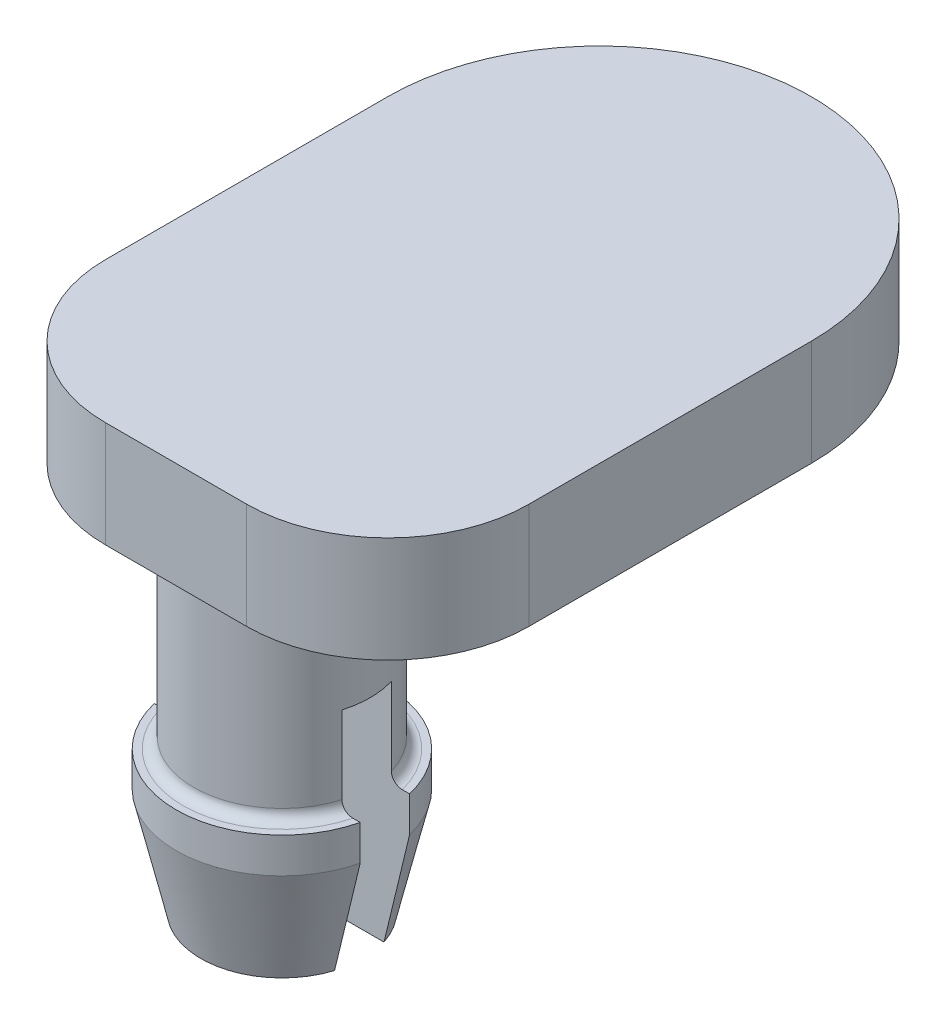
ISO-10303-21;
HEADER;
FILE_DESCRIPTION(('STEP AP214'),'2;1');
FILE_NAME('part.step','',(''),(''),'','','');
FILE_SCHEMA(('AUTOMOTIVE_DESIGN { 1 0 10303 214 1 1 1 1 }'));
ENDSEC;
DATA;
#1=APPLICATION_CONTEXT('core data for automotive mechanical design processes');
#2=APPLICATION_PROTOCOL_DEFINITION('international standard','automotive_design',2000,#1);
#3=PRODUCT_CONTEXT('',#1,'mechanical');
#4=PRODUCT('Part','Part','',(#3));
#5=PRODUCT_RELATED_PRODUCT_CATEGORY('part','',(#4));
#6=PRODUCT_DEFINITION_FORMATION('','',#4);
#7=PRODUCT_DEFINITION_CONTEXT('part definition',#1,'design');
#8=PRODUCT_DEFINITION('design','',#6,#7);
#9=PRODUCT_DEFINITION_SHAPE('','',#8);
#10=(LENGTH_UNIT() NAMED_UNIT(*) SI_UNIT(.MILLI.,.METRE.));
#11=(NAMED_UNIT(*) PLANE_ANGLE_UNIT() SI_UNIT($,.RADIAN.));
#12=(NAMED_UNIT(*) SI_UNIT($,.STERADIAN.) SOLID_ANGLE_UNIT());
#13=UNCERTAINTY_MEASURE_WITH_UNIT(LENGTH_MEASURE(1.E-05),#10,'distance_accuracy_value','');
#14=(GEOMETRIC_REPRESENTATION_CONTEXT(3) GLOBAL_UNCERTAINTY_ASSIGNED_CONTEXT((#13)) GLOBAL_UNIT_ASSIGNED_CONTEXT((#10,
#11,#12)) REPRESENTATION_CONTEXT('',''));
#15=CARTESIAN_POINT('',(0.,0.,0.));
#16=DIRECTION('',(0.,0.,1.));
#17=DIRECTION('',(1.,0.,0.));
#18=AXIS2_PLACEMENT_3D('',#15,#16,#17);
#19=CARTESIAN_POINT('',(0.,-9.5,0.));
#20=DIRECTION('',(0.,1.,0.));
#21=DIRECTION('',(0.,0.,1.));
#22=AXIS2_PLACEMENT_3D('',#19,#20,#21);
#23=CYLINDRICAL_SURFACE('',#22,3.);
#24=CARTESIAN_POINT('',(0.,-6.49999999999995,0.));
#25=DIRECTION('',(0.,-1.,0.));
#26=DIRECTION('',(0.,0.,-1.));
#27=AXIS2_PLACEMENT_3D('',#24,#25,#26);
#28=CIRCLE('',#27,3.);
#29=CARTESIAN_POINT('',(-2.91719042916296,-6.49999999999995,0.7));
#30=VERTEX_POINT('',#29);
#31=CARTESIAN_POINT('',(2.91719042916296,-6.49999999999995,0.7));
#32=VERTEX_POINT('',#31);
#33=EDGE_CURVE('E178',#30,#32,#28,.F.);
#34=ORIENTED_EDGE('',*,*,#33,.T.);
#35=DIRECTION('',(0.,1.,0.));
#36=VECTOR('',#35,1.);
#37=CARTESIAN_POINT('',(2.91719042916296,-9.5,0.700000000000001));
#38=LINE('',#37,#36);
#39=CARTESIAN_POINT('',(2.91719042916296,-5.5,0.7));
#40=VERTEX_POINT('',#39);
#41=EDGE_CURVE('E376',#32,#40,#38,.T.);
#42=ORIENTED_EDGE('',*,*,#41,.T.);
#43=CARTESIAN_POINT('',(0.,-5.5,0.));
#44=DIRECTION('',(0.,-1.,0.));
#45=DIRECTION('',(0.,0.,-1.));
#46=AXIS2_PLACEMENT_3D('',#43,#44,#45);
#47=CIRCLE('',#46,3.);
#48=CARTESIAN_POINT('',(-2.91719042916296,-5.5,0.7));
#49=VERTEX_POINT('',#48);
#50=EDGE_CURVE('E138',#40,#49,#47,.T.);
#51=ORIENTED_EDGE('',*,*,#50,.T.);
#52=DIRECTION('',(0.,1.,0.));
#53=VECTOR('',#52,1.);
#54=CARTESIAN_POINT('',(-2.91719042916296,-9.5,0.700000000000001));
#55=LINE('',#54,#53);
#56=EDGE_CURVE('E243',#49,#30,#55,.F.);
#57=ORIENTED_EDGE('',*,*,#56,.T.);
#58=EDGE_LOOP('',(#34,#42,#51,#57));
#59=FACE_BOUND('',#58,.T.);
#60=ADVANCED_FACE('F33',(#59),#23,.T.);
#61=CARTESIAN_POINT('',(0.,-9.5,0.));
#62=DIRECTION('',(0.,-1.,0.));
#63=DIRECTION('',(0.,0.,-1.));
#64=AXIS2_PLACEMENT_3D('',#61,#62,#63);
#65=PLANE('',#64);
#66=DIRECTION('',(-1.,0.,0.));
#67=VECTOR('',#66,1.);
#68=CARTESIAN_POINT('',(3.70455758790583,-9.5,0.700000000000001));
#69=LINE('',#68,#67);
#70=CARTESIAN_POINT('',(2.19089023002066,-9.5,0.7));
#71=VERTEX_POINT('',#70);
#72=CARTESIAN_POINT('',(-2.19089023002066,-9.5,0.7));
#73=VERTEX_POINT('',#72);
#74=EDGE_CURVE('E398',#71,#73,#69,.T.);
#75=ORIENTED_EDGE('',*,*,#74,.F.);
#76=CARTESIAN_POINT('',(0.,-9.5,0.));
#77=DIRECTION('',(0.,-1.,0.));
#78=DIRECTION('',(0.,0.,-1.));
#79=AXIS2_PLACEMENT_3D('',#76,#77,#78);
#80=CIRCLE('',#79,2.3);
#81=EDGE_CURVE('E174',#71,#73,#80,.T.);
#82=ORIENTED_EDGE('',*,*,#81,.T.);
#83=EDGE_LOOP('',(#75,#82));
#84=FACE_BOUND('',#83,.T.);
#85=ADVANCED_FACE('F273',(#84),#65,.T.);
#86=CARTESIAN_POINT('',(0.,-5.5,0.));
#87=DIRECTION('',(0.,-1.,0.));
#88=DIRECTION('',(0.,0.,-1.));
#89=AXIS2_PLACEMENT_3D('',#86,#87,#88);
#90=PLANE('',#89);
#91=ORIENTED_EDGE('',*,*,#50,.F.);
#92=DIRECTION('',(-1.,0.,0.));
#93=VECTOR('',#92,1.);
#94=CARTESIAN_POINT('',(0.,-5.5,0.7));
#95=LINE('',#94,#93);
#96=CARTESIAN_POINT('',(2.71108834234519,-5.5,0.7));
#97=VERTEX_POINT('',#96);
#98=EDGE_CURVE('E239',#40,#97,#95,.T.);
#99=ORIENTED_EDGE('',*,*,#98,.T.);
#100=CARTESIAN_POINT('',(0.,-5.5,0.));
#101=DIRECTION('',(0.,-1.,0.));
#102=DIRECTION('',(0.,0.,-1.));
#103=AXIS2_PLACEMENT_3D('',#100,#101,#102);
#104=CIRCLE('',#103,2.8);
#105=CARTESIAN_POINT('',(-2.71108834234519,-5.5,0.7));
#106=VERTEX_POINT('',#105);
#107=EDGE_CURVE('E170',#97,#106,#104,.T.);
#108=ORIENTED_EDGE('',*,*,#107,.T.);
#109=EDGE_CURVE('E245',#106,#49,#95,.T.);
#110=ORIENTED_EDGE('',*,*,#109,.T.);
#111=EDGE_LOOP('',(#91,#99,#108,#110));
#112=FACE_BOUND('',#111,.T.);
#113=ADVANCED_FACE('F280',(#112),#90,.F.);
#114=CARTESIAN_POINT('',(0.,-5.2,0.));
#115=DIRECTION('',(0.,-1.,0.));
#116=DIRECTION('',(0.,0.,-1.));
#117=AXIS2_PLACEMENT_3D('',#114,#115,#116);
#118=TOROIDAL_SURFACE('',#117,2.8,0.3);
#119=CARTESIAN_POINT('',(0.,-5.2,0.));
#120=DIRECTION('',(0.,-1.,0.));
#121=DIRECTION('',(0.,0.,-1.));
#122=AXIS2_PLACEMENT_3D('',#119,#120,#121);
#123=CIRCLE('',#122,2.5);
#124=CARTESIAN_POINT('',(-2.4,-5.2,0.7));
#125=VERTEX_POINT('',#124);
#126=CARTESIAN_POINT('',(2.39999999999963,-5.2,0.7));
#127=VERTEX_POINT('',#126);
#128=EDGE_CURVE('E160',#125,#127,#123,.F.);
#129=ORIENTED_EDGE('',*,*,#128,.F.);
#130=CARTESIAN_POINT('',(-2.71383630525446,-5.49998820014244,0.7));
#131=CARTESIAN_POINT('',(-2.73159105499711,-5.49983502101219,0.7));
#132=CARTESIAN_POINT('',(-2.74934554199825,-5.49820097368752,0.7));
#133=CARTESIAN_POINT('',(-2.78434827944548,-5.49199092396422,0.7));
#134=CARTESIAN_POINT('',(-2.80159592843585,-5.48741156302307,0.7));
#135=CARTESIAN_POINT('',(-2.83508163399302,-5.47540469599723,0.7));
#136=CARTESIAN_POINT('',(-2.8513192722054,-5.46797601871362,0.7));
#137=CARTESIAN_POINT('',(-2.88228124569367,-5.45045120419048,0.7));
#138=CARTESIAN_POINT('',(-2.89700605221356,-5.44035590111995,0.7));
#139=CARTESIAN_POINT('',(-2.92423731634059,-5.41796295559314,0.7));
#140=CARTESIAN_POINT('',(-2.9367785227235,-5.40570760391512,0.7));
#141=CARTESIAN_POINT('',(-2.95955305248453,-5.37921141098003,0.7));
#142=CARTESIAN_POINT('',(-2.96978664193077,-5.36497079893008,0.7));
#143=CARTESIAN_POINT('',(-2.98735192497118,-5.33533941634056,0.7));
#144=CARTESIAN_POINT('',(-2.99475697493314,-5.31999212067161,0.7));
#145=CARTESIAN_POINT('',(-3.00681789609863,-5.2882529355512,0.7));
#146=CARTESIAN_POINT('',(-3.01147416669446,-5.27186119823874,0.7));
#147=CARTESIAN_POINT('',(-3.01780911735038,-5.23889238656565,0.7));
#148=CARTESIAN_POINT('',(-3.01955192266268,-5.22232761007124,0.7));
#149=CARTESIAN_POINT('',(-3.02020306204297,-5.18914302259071,0.7));
#150=CARTESIAN_POINT('',(-3.01911160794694,-5.17252321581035,0.7));
#151=CARTESIAN_POINT('',(-3.01415374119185,-5.13986138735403,0.7));
#152=CARTESIAN_POINT('',(-3.01031309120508,-5.12381544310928,0.7));
#153=CARTESIAN_POINT('',(-3.00000846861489,-5.09259021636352,0.7));
#154=CARTESIAN_POINT('',(-2.9935444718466,-5.07741094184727,0.7));
#155=CARTESIAN_POINT('',(-2.97814713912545,-5.04824156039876,0.7));
#156=CARTESIAN_POINT('',(-2.9691987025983,-5.03425943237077,0.7));
#157=CARTESIAN_POINT('',(-2.94912358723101,-5.0079591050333,0.7));
#158=CARTESIAN_POINT('',(-2.93799673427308,-4.99564103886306,0.7));
#159=CARTESIAN_POINT('',(-2.91365452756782,-4.97275497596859,0.7));
#160=CARTESIAN_POINT('',(-2.90040258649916,-4.96222591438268,0.7));
#161=CARTESIAN_POINT('',(-2.87235802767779,-4.9434732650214,0.7));
#162=CARTESIAN_POINT('',(-2.85756521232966,-4.93524997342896,0.7));
#163=CARTESIAN_POINT('',(-2.82643381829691,-4.92110675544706,0.7));
#164=CARTESIAN_POINT('',(-2.81006432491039,-4.91525487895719,0.7));
#165=CARTESIAN_POINT('',(-2.776588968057,-4.90630631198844,0.7));
#166=CARTESIAN_POINT('',(-2.75948300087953,-4.90321001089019,0.7));
#167=CARTESIAN_POINT('',(-2.72455784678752,-4.89978942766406,0.7));
#168=CARTESIAN_POINT('',(-2.70673156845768,-4.8995373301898,0.7));
#169=CARTESIAN_POINT('',(-2.67128230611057,-4.90198753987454,0.7));
#170=CARTESIAN_POINT('',(-2.65365934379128,-4.90469015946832,0.7));
#171=CARTESIAN_POINT('',(-2.6188790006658,-4.9130340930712,0.7));
#172=CARTESIAN_POINT('',(-2.60173065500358,-4.91871316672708,0.7));
#173=CARTESIAN_POINT('',(-2.5686405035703,-4.93289181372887,0.7));
#174=CARTESIAN_POINT('',(-2.55269870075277,-4.94139139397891,0.7));
#175=CARTESIAN_POINT('',(-2.52262928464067,-4.96091980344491,0.7));
#176=CARTESIAN_POINT('',(-2.50848800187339,-4.97192755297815,0.7));
#177=CARTESIAN_POINT('',(-2.48232442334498,-4.99622699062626,0.7));
#178=CARTESIAN_POINT('',(-2.47030179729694,-5.0095183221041,0.7));
#179=CARTESIAN_POINT('',(-2.44911194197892,-5.03759460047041,0.7));
#180=CARTESIAN_POINT('',(-2.43987064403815,-5.05232360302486,0.7));
#181=CARTESIAN_POINT('',(-2.42410600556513,-5.08317096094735,0.7));
#182=CARTESIAN_POINT('',(-2.4175819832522,-5.09928896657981,0.7));
#183=CARTESIAN_POINT('',(-2.40769083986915,-5.13179740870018,0.7));
#184=CARTESIAN_POINT('',(-2.40421329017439,-5.14815428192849,0.7));
#185=CARTESIAN_POINT('',(-2.40013127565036,-5.18122192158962,0.7));
#186=CARTESIAN_POINT('',(-2.39952631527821,-5.19793262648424,0.7));
#187=CARTESIAN_POINT('',(-2.4011903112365,-5.23079453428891,0.7));
#188=CARTESIAN_POINT('',(-2.40338870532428,-5.24694936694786,0.7));
#189=CARTESIAN_POINT('',(-2.41045945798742,-5.27866156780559,0.7));
#190=CARTESIAN_POINT('',(-2.41533178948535,-5.29421894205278,0.7));
#191=CARTESIAN_POINT('',(-2.42760087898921,-5.32435769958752,0.7));
#192=CARTESIAN_POINT('',(-2.43500535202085,-5.33893593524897,0.7));
#193=CARTESIAN_POINT('',(-2.4520923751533,-5.36668755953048,0.7));
#194=CARTESIAN_POINT('',(-2.4617751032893,-5.37986083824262,0.7));
#195=CARTESIAN_POINT('',(-2.48342280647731,-5.40482959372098,0.7));
#196=CARTESIAN_POINT('',(-2.49544395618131,-5.41657633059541,0.7));
#197=CARTESIAN_POINT('',(-2.52122898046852,-5.43797577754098,0.7));
#198=CARTESIAN_POINT('',(-2.53499358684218,-5.44762760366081,0.7));
#199=CARTESIAN_POINT('',(-2.56442485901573,-5.46493723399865,0.7));
#200=CARTESIAN_POINT('',(-2.58014355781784,-5.47250649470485,0.7));
#201=CARTESIAN_POINT('',(-2.61259296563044,-5.4849728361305,0.7));
#202=CARTESIAN_POINT('',(-2.62932266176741,-5.48987254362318,0.7));
#203=CARTESIAN_POINT('',(-2.65742303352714,-5.49567516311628,0.7));
#204=CARTESIAN_POINT('',(-2.66863553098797,-5.49737531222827,0.7));
#205=CARTESIAN_POINT('',(-2.69117748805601,-5.49958071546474,0.7));
#206=CARTESIAN_POINT('',(-2.70250695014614,-5.50008594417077,0.7));
#207=CARTESIAN_POINT('',(-2.71383630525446,-5.49998820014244,0.7));
#208=B_SPLINE_CURVE_WITH_KNOTS('',3,(#130,#131,#132,#133,#134,#135,#136,#137,#138,#139,#140,
#141,#142,#143,#144,#145,#146,#147,#148,#149,#150,#151,#152,#153,#154,#155,#156,#157,#158,#159,
#160,#161,#162,#163,#164,#165,#166,#167,#168,#169,#170,#171,#172,#173,#174,#175,#176,#177,#178,
#179,#180,#181,#182,#183,#184,#185,#186,#187,#188,#189,#190,#191,#192,#193,#194,#195,#196,#197,
#198,#199,#200,#201,#202,#203,#204,#205,#206,#207),.UNSPECIFIED.,.T.,.F.,(4,2,2,2,2,2,2,2,2,2,2,
2,2,2,2,2,2,2,2,2,2,2,2,2,2,2,2,2,2,2,2,2,2,2,2,2,2,2,4),(0.,0.0532257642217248,
0.106512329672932,0.159820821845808,0.21311265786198,0.265458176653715,0.317797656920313,
0.368668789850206,0.419532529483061,0.4692612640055,0.51898628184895,0.568251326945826,
0.617516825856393,0.667088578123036,0.716664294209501,0.767209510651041,0.817761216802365,
0.869675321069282,0.921596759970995,0.974833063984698,1.0280749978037,1.08200932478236,
1.13594378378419,1.1894406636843,1.24292919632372,1.29483240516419,1.34672258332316,
1.39664313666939,1.44655507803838,1.49523514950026,1.54391472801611,1.59274396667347,
1.64157702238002,1.69177356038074,1.74199123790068,1.79409567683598,1.84614875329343,
1.88011153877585,1.91407504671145),.UNSPECIFIED.);
#209=EDGE_CURVE('E246',#125,#106,#208,.T.);
#210=ORIENTED_EDGE('',*,*,#209,.T.);
#211=ORIENTED_EDGE('',*,*,#107,.F.);
#212=CARTESIAN_POINT('',(2.42624297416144,-5.32036248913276,0.7));
#213=CARTESIAN_POINT('',(2.41948984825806,-5.3055472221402,0.7));
#214=CARTESIAN_POINT('',(2.41396436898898,-5.29016160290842,0.7));
#215=CARTESIAN_POINT('',(2.40556635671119,-5.25867158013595,0.7));
#216=CARTESIAN_POINT('',(2.40269604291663,-5.24256658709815,0.7));
#217=CARTESIAN_POINT('',(2.39971633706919,-5.21009984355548,0.7));
#218=CARTESIAN_POINT('',(2.3996072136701,-5.1937380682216,0.7));
#219=CARTESIAN_POINT('',(2.40215515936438,-5.16123504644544,0.7));
#220=CARTESIAN_POINT('',(2.40481173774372,-5.14509376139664,0.7));
#221=CARTESIAN_POINT('',(2.412773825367,-5.11356839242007,0.7));
#222=CARTESIAN_POINT('',(2.41806566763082,-5.09818084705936,0.7));
#223=CARTESIAN_POINT('',(2.43111075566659,-5.06848831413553,0.7));
#224=CARTESIAN_POINT('',(2.43886423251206,-5.05418342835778,0.7));
#225=CARTESIAN_POINT('',(2.45675241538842,-5.02676134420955,0.7));
#226=CARTESIAN_POINT('',(2.46692950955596,-5.01367182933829,0.7));
#227=CARTESIAN_POINT('',(2.48926715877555,-4.98931301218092,0.7));
#228=CARTESIAN_POINT('',(2.50142803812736,-4.97804400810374,0.7));
#229=CARTESIAN_POINT('',(2.52784954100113,-4.95721842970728,0.7));
#230=CARTESIAN_POINT('',(2.54216955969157,-4.947737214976,0.7));
#231=CARTESIAN_POINT('',(2.57215687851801,-4.93122138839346,0.7));
#232=CARTESIAN_POINT('',(2.58782441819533,-4.92418721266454,0.7));
#233=CARTESIAN_POINT('',(2.6206295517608,-4.9125302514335,0.7));
#234=CARTESIAN_POINT('',(2.63779888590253,-4.907996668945,0.7));
#235=CARTESIAN_POINT('',(2.6726508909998,-4.90182315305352,0.7));
#236=CARTESIAN_POINT('',(2.69033362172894,-4.90018355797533,0.7));
#237=CARTESIAN_POINT('',(2.72602249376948,-4.89984284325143,0.7));
#238=CARTESIAN_POINT('',(2.74402913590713,-4.90119089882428,0.7));
#239=CARTESIAN_POINT('',(2.77955774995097,-4.90690738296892,0.7));
#240=CARTESIAN_POINT('',(2.79707972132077,-4.91127581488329,0.7));
#241=CARTESIAN_POINT('',(2.83102832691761,-4.92290478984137,0.7));
#242=CARTESIAN_POINT('',(2.84746054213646,-4.93014901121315,0.7));
#243=CARTESIAN_POINT('',(2.87883634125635,-4.94735460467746,0.7));
#244=CARTESIAN_POINT('',(2.89378008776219,-4.95731567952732,0.7));
#245=CARTESIAN_POINT('',(2.92138936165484,-4.97944056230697,0.7));
#246=CARTESIAN_POINT('',(2.93409845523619,-4.99154997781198,0.7));
#247=CARTESIAN_POINT('',(2.9572308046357,-5.01778518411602,0.7));
#248=CARTESIAN_POINT('',(2.96765443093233,-5.03191064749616,0.7));
#249=CARTESIAN_POINT('',(2.98561015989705,-5.06134879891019,0.7));
#250=CARTESIAN_POINT('',(2.9932153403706,-5.0766169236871,0.7));
#251=CARTESIAN_POINT('',(3.00568609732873,-5.10823377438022,0.7));
#252=CARTESIAN_POINT('',(3.01055206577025,-5.1245823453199,0.7));
#253=CARTESIAN_POINT('',(3.01730278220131,-5.15749638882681,0.7));
#254=CARTESIAN_POINT('',(3.01925265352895,-5.17404852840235,0.7));
#255=CARTESIAN_POINT('',(3.02031541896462,-5.20724308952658,0.7));
#256=CARTESIAN_POINT('',(3.01942853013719,-5.22388550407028,0.7));
#257=CARTESIAN_POINT('',(3.0148700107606,-5.25661696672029,0.7));
#258=CARTESIAN_POINT('',(3.01122574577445,-5.27270983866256,0.7));
#259=CARTESIAN_POINT('',(3.00130181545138,-5.30406041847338,0.7));
#260=CARTESIAN_POINT('',(2.99502213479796,-5.31931812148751,0.7));
#261=CARTESIAN_POINT('',(2.97998126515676,-5.34866514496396,0.7));
#262=CARTESIAN_POINT('',(2.97120621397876,-5.36274735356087,0.7));
#263=CARTESIAN_POINT('',(2.9514581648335,-5.38927422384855,0.7));
#264=CARTESIAN_POINT('',(2.9404849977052,-5.40171875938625,0.7));
#265=CARTESIAN_POINT('',(2.91643426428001,-5.42487802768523,0.7));
#266=CARTESIAN_POINT('',(2.9033204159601,-5.43555506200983,0.7));
#267=CARTESIAN_POINT('',(2.87552581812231,-5.45462388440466,0.7));
#268=CARTESIAN_POINT('',(2.8608448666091,-5.46301537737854,0.7));
#269=CARTESIAN_POINT('',(2.82991318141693,-5.47751447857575,0.7));
#270=CARTESIAN_POINT('',(2.81363090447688,-5.48355479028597,0.7));
#271=CARTESIAN_POINT('',(2.7802981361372,-5.49289261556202,0.7));
#272=CARTESIAN_POINT('',(2.76324753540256,-5.49618973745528,0.7));
#273=CARTESIAN_POINT('',(2.72839638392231,-5.50002541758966,0.7));
#274=CARTESIAN_POINT('',(2.71058780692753,-5.50049123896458,0.7));
#275=CARTESIAN_POINT('',(2.67513873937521,-5.49847032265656,0.7));
#276=CARTESIAN_POINT('',(2.65749826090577,-5.49598337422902,0.7));
#277=CARTESIAN_POINT('',(2.62263698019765,-5.48806885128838,0.7));
#278=CARTESIAN_POINT('',(2.60542508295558,-5.48260195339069,0.7));
#279=CARTESIAN_POINT('',(2.57216705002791,-5.46883454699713,0.7));
#280=CARTESIAN_POINT('',(2.5561212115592,-5.46053331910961,0.7));
#281=CARTESIAN_POINT('',(2.5257906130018,-5.44137098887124,0.7));
#282=CARTESIAN_POINT('',(2.51149464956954,-5.43052762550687,0.7));
#283=CARTESIAN_POINT('',(2.48500824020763,-5.40653661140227,0.7));
#284=CARTESIAN_POINT('',(2.47281492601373,-5.39339214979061,0.7));
#285=CARTESIAN_POINT('',(2.45483427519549,-5.37019097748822,0.7));
#286=CARTESIAN_POINT('',(2.44831005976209,-5.36069625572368,0.7));
#287=CARTESIAN_POINT('',(2.43640055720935,-5.34101677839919,0.7));
#288=CARTESIAN_POINT('',(2.43101522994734,-5.3308320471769,0.7));
#289=CARTESIAN_POINT('',(2.42624297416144,-5.32036248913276,0.7));
#290=B_SPLINE_CURVE_WITH_KNOTS('',3,(#212,#213,#214,#215,#216,#217,#218,#219,#220,#221,#222,
#223,#224,#225,#226,#227,#228,#229,#230,#231,#232,#233,#234,#235,#236,#237,#238,#239,#240,#241,
#242,#243,#244,#245,#246,#247,#248,#249,#250,#251,#252,#253,#254,#255,#256,#257,#258,#259,#260,
#261,#262,#263,#264,#265,#266,#267,#268,#269,#270,#271,#272,#273,#274,#275,#276,#277,#278,#279,
#280,#281,#282,#283,#284,#285,#286,#287,#288,#289),.UNSPECIFIED.,.T.,.F.,(4,2,2,2,2,2,2,2,2,2,2,
2,2,2,2,2,2,2,2,2,2,2,2,2,2,2,2,2,2,2,2,2,2,2,2,2,2,2,4),(0.,0.0488044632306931,
0.0976496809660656,0.146499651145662,0.195340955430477,0.243931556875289,0.292526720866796,
0.342043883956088,0.391569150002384,0.442859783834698,0.494159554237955,0.547187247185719,
0.600221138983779,0.654134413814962,0.708047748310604,0.761659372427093,0.815265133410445,
0.867669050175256,0.920064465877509,0.970986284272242,1.02190081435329,1.07166037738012,
1.12141613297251,1.17068446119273,1.21995307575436,1.26950091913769,1.31905257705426,
1.3695533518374,1.42006064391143,1.47192266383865,1.52379208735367,1.57698860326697,
1.63018891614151,1.68410888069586,1.73804254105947,1.79161050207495,1.84510480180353,
1.87959484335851,1.91408366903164),.UNSPECIFIED.);
#291=EDGE_CURVE('E232',#97,#127,#290,.T.);
#292=ORIENTED_EDGE('',*,*,#291,.T.);
#293=EDGE_LOOP('',(#129,#210,#211,#292));
#294=FACE_BOUND('',#293,.T.);
#295=ADVANCED_FACE('F221',(#294),#118,.F.);
#296=CARTESIAN_POINT('',(0.,-9.5,0.));
#297=DIRECTION('',(0.,1.,0.));
#298=DIRECTION('',(0.,0.,1.));
#299=AXIS2_PLACEMENT_3D('',#296,#297,#298);
#300=CONICAL_SURFACE('',#299,2.3,0.229231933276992);
#301=CARTESIAN_POINT('',(-1.3915737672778,-12.6812193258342,0.700000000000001));
#302=CARTESIAN_POINT('',(-1.44501828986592,-12.4765209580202,0.700000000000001));
#303=CARTESIAN_POINT('',(-1.49792067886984,-12.2716822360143,0.700000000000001));
#304=CARTESIAN_POINT('',(-1.60286960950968,-11.861786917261,0.700000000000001));
#305=CARTESIAN_POINT('',(-1.65491615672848,-11.6567303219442,0.700000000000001));
#306=CARTESIAN_POINT('',(-1.7583817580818,-11.2464624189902,0.700000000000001));
#307=CARTESIAN_POINT('',(-1.80980082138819,-11.0412511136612,0.700000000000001));
#308=CARTESIAN_POINT('',(-1.91214728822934,-10.630705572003,0.700000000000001));
#309=CARTESIAN_POINT('',(-1.96307469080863,-10.4253713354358,0.700000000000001));
#310=CARTESIAN_POINT('',(-2.13244723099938,-9.73974610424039,0.700000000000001));
#311=CARTESIAN_POINT('',(-2.2500378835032,-9.2592441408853,0.700000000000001));
#312=CARTESIAN_POINT('',(-2.52549877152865,-8.12715784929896,0.7));
#313=CARTESIAN_POINT('',(-2.68283627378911,-7.47544422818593,0.7));
#314=CARTESIAN_POINT('',(-2.99614517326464,-6.17168790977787,0.7));
#315=CARTESIAN_POINT('',(-3.15211656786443,-5.51964521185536,0.7));
#316=CARTESIAN_POINT('',(-3.56522170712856,-3.78759500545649,0.7));
#317=CARTESIAN_POINT('',(-3.82160542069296,-2.70740873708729,0.7));
#318=CARTESIAN_POINT('',(-4.33312357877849,-0.546739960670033,0.7));
#319=CARTESIAN_POINT('',(-4.58825802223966,0.533742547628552,0.7));
#320=CARTESIAN_POINT('',(-5.0977639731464,2.69486777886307,0.7));
#321=CARTESIAN_POINT('',(-5.35213549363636,3.77551049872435,0.7));
#322=CARTESIAN_POINT('',(-5.86036591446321,5.93691446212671,0.7));
#323=CARTESIAN_POINT('',(-6.11422481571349,7.01767570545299,0.7));
#324=CARTESIAN_POINT('',(-6.36795081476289,8.09846800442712,0.7));
#325=B_SPLINE_CURVE_WITH_KNOTS('',3,(#301,#302,#303,#304,#305,#306,#307,#308,#309,#310,#311,
#312,#313,#314,#315,#316,#317,#318,#319,#320,#321,#322,#323,#324),.UNSPECIFIED.,.F.,.F.,(4,2,2,
2,2,2,2,2,2,2,2,4),(0.,0.634678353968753,1.26935256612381,1.90401749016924,2.53868364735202,
4.02272448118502,6.03403301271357,8.04534539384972,11.3759314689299,14.7065203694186,
18.037051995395,21.3675776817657),.UNSPECIFIED.);
#326=EDGE_CURVE('E389',#73,#30,#325,.T.);
#327=ORIENTED_EDGE('',*,*,#326,.F.);
#328=ORIENTED_EDGE('',*,*,#81,.F.);
#329=CARTESIAN_POINT('',(1.3915737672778,-12.6812193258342,0.700000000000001));
#330=CARTESIAN_POINT('',(1.44501828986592,-12.4765209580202,0.700000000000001));
#331=CARTESIAN_POINT('',(1.49792067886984,-12.2716822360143,0.700000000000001));
#332=CARTESIAN_POINT('',(1.60286960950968,-11.861786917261,0.700000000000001));
#333=CARTESIAN_POINT('',(1.65491615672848,-11.6567303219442,0.700000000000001));
#334=CARTESIAN_POINT('',(1.7583817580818,-11.2464624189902,0.700000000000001));
#335=CARTESIAN_POINT('',(1.80980082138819,-11.0412511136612,0.700000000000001));
#336=CARTESIAN_POINT('',(1.91214728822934,-10.630705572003,0.700000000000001));
#337=CARTESIAN_POINT('',(1.96307469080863,-10.4253713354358,0.700000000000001));
#338=CARTESIAN_POINT('',(2.13244723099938,-9.73974610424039,0.700000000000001));
#339=CARTESIAN_POINT('',(2.2500378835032,-9.2592441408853,0.700000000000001));
#340=CARTESIAN_POINT('',(2.52549877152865,-8.12715784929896,0.7));
#341=CARTESIAN_POINT('',(2.68283627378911,-7.47544422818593,0.7));
#342=CARTESIAN_POINT('',(2.99614517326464,-6.17168790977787,0.7));
#343=CARTESIAN_POINT('',(3.15211656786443,-5.51964521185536,0.7));
#344=CARTESIAN_POINT('',(3.56522170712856,-3.78759500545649,0.7));
#345=CARTESIAN_POINT('',(3.82160542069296,-2.70740873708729,0.7));
#346=CARTESIAN_POINT('',(4.33312357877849,-0.546739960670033,0.7));
#347=CARTESIAN_POINT('',(4.58825802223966,0.533742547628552,0.7));
#348=CARTESIAN_POINT('',(5.0977639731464,2.69486777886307,0.7));
#349=CARTESIAN_POINT('',(5.35213549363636,3.77551049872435,0.7));
#350=CARTESIAN_POINT('',(5.86036591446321,5.93691446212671,0.7));
#351=CARTESIAN_POINT('',(6.11422481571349,7.01767570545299,0.7));
#352=CARTESIAN_POINT('',(6.36795081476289,8.09846800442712,0.7));
#353=B_SPLINE_CURVE_WITH_KNOTS('',3,(#329,#330,#331,#332,#333,#334,#335,#336,#337,#338,#339,
#340,#341,#342,#343,#344,#345,#346,#347,#348,#349,#350,#351,#352),.UNSPECIFIED.,.F.,.F.,(4,2,2,
2,2,2,2,2,2,2,2,4),(0.,0.634678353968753,1.26935256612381,1.90401749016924,2.53868364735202,
4.02272448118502,6.03403301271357,8.04534539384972,11.3759314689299,14.7065203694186,
18.037051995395,21.3675776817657),.UNSPECIFIED.);
#354=EDGE_CURVE('E383',#32,#71,#353,.F.);
#355=ORIENTED_EDGE('',*,*,#354,.F.);
#356=ORIENTED_EDGE('',*,*,#33,.F.);
#357=EDGE_LOOP('',(#327,#328,#355,#356));
#358=FACE_BOUND('',#357,.T.);
#359=ADVANCED_FACE('F270',(#358),#300,.T.);
#360=CARTESIAN_POINT('',(0.,3.,-9.));
#361=DIRECTION('',(0.,-1.,0.));
#362=DIRECTION('',(0.,0.,-1.));
#363=AXIS2_PLACEMENT_3D('',#360,#361,#362);
#364=CYLINDRICAL_SURFACE('',#363,6.);
#365=CARTESIAN_POINT('',(0.,0.,-9.));
#366=DIRECTION('',(0.,-1.,0.));
#367=DIRECTION('',(0.,0.,-1.));
#368=AXIS2_PLACEMENT_3D('',#365,#366,#367);
#369=CIRCLE('',#368,6.);
#370=CARTESIAN_POINT('',(-6.,0.,-9.));
#371=VERTEX_POINT('',#370);
#372=CARTESIAN_POINT('',(6.,0.,-9.));
#373=VERTEX_POINT('',#372);
#374=EDGE_CURVE('E134',#371,#373,#369,.T.);
#375=ORIENTED_EDGE('',*,*,#374,.F.);
#376=DIRECTION('',(0.,-1.,0.));
#377=VECTOR('',#376,1.);
#378=CARTESIAN_POINT('',(-6.,3.,-9.));
#379=LINE('',#378,#377);
#380=CARTESIAN_POINT('',(-6.,3.,-9.));
#381=VERTEX_POINT('',#380);
#382=EDGE_CURVE('E58',#381,#371,#379,.T.);
#383=ORIENTED_EDGE('',*,*,#382,.F.);
#384=CARTESIAN_POINT('',(0.,3.,-9.));
#385=DIRECTION('',(0.,-1.,0.));
#386=DIRECTION('',(0.,0.,-1.));
#387=AXIS2_PLACEMENT_3D('',#384,#385,#386);
#388=CIRCLE('',#387,6.);
#389=CARTESIAN_POINT('',(6.,3.,-9.));
#390=VERTEX_POINT('',#389);
#391=EDGE_CURVE('E150',#381,#390,#388,.T.);
#392=ORIENTED_EDGE('',*,*,#391,.T.);
#393=DIRECTION('',(0.,-1.,0.));
#394=VECTOR('',#393,1.);
#395=CARTESIAN_POINT('',(6.,3.,-9.));
#396=LINE('',#395,#394);
#397=EDGE_CURVE('E91',#390,#373,#396,.T.);
#398=ORIENTED_EDGE('',*,*,#397,.T.);
#399=EDGE_LOOP('',(#375,#383,#392,#398));
#400=FACE_BOUND('',#399,.T.);
#401=ADVANCED_FACE('F259',(#400),#364,.T.);
#402=CARTESIAN_POINT('',(-6.,3.,-1.));
#403=DIRECTION('',(-1.,0.,0.));
#404=DIRECTION('',(0.,0.,1.));
#405=AXIS2_PLACEMENT_3D('',#402,#403,#404);
#406=PLANE('',#405);
#407=DIRECTION('',(0.,0.,-1.));
#408=VECTOR('',#407,1.);
#409=CARTESIAN_POINT('',(-6.,0.,-1.));
#410=LINE('',#409,#408);
#411=CARTESIAN_POINT('',(-6.,0.,-1.));
#412=VERTEX_POINT('',#411);
#413=EDGE_CURVE('E147',#412,#371,#410,.T.);
#414=ORIENTED_EDGE('',*,*,#413,.F.);
#415=DIRECTION('',(0.,-1.,0.));
#416=VECTOR('',#415,1.);
#417=CARTESIAN_POINT('',(-6.,3.,-1.));
#418=LINE('',#417,#416);
#419=CARTESIAN_POINT('',(-6.,3.,-1.));
#420=VERTEX_POINT('',#419);
#421=EDGE_CURVE('E115',#420,#412,#418,.T.);
#422=ORIENTED_EDGE('',*,*,#421,.F.);
#423=DIRECTION('',(0.,0.,-1.));
#424=VECTOR('',#423,1.);
#425=CARTESIAN_POINT('',(-6.,3.,-1.));
#426=LINE('',#425,#424);
#427=EDGE_CURVE('E124',#420,#381,#426,.T.);
#428=ORIENTED_EDGE('',*,*,#427,.T.);
#429=ORIENTED_EDGE('',*,*,#382,.T.);
#430=EDGE_LOOP('',(#414,#422,#428,#429));
#431=FACE_BOUND('',#430,.T.);
#432=ADVANCED_FACE('F262',(#431),#406,.T.);
#433=CARTESIAN_POINT('',(-2.,3.,-1.));
#434=DIRECTION('',(0.,-1.,0.));
#435=DIRECTION('',(0.,0.,-1.));
#436=AXIS2_PLACEMENT_3D('',#433,#434,#435);
#437=CYLINDRICAL_SURFACE('',#436,4.);
#438=CARTESIAN_POINT('',(-2.,0.,-1.));
#439=DIRECTION('',(0.,-1.,0.));
#440=DIRECTION('',(0.,0.,1.));
#441=AXIS2_PLACEMENT_3D('',#438,#439,#440);
#442=CIRCLE('',#441,4.);
#443=CARTESIAN_POINT('',(-2.,0.,3.));
#444=VERTEX_POINT('',#443);
#445=EDGE_CURVE('E110',#444,#412,#442,.T.);
#446=ORIENTED_EDGE('',*,*,#445,.F.);
#447=DIRECTION('',(0.,-1.,0.));
#448=VECTOR('',#447,1.);
#449=CARTESIAN_POINT('',(-2.,3.,3.));
#450=LINE('',#449,#448);
#451=CARTESIAN_POINT('',(-2.,3.,3.));
#452=VERTEX_POINT('',#451);
#453=EDGE_CURVE('E104',#452,#444,#450,.T.);
#454=ORIENTED_EDGE('',*,*,#453,.F.);
#455=CARTESIAN_POINT('',(-2.,3.,-1.));
#456=DIRECTION('',(0.,-1.,0.));
#457=DIRECTION('',(0.,0.,1.));
#458=AXIS2_PLACEMENT_3D('',#455,#456,#457);
#459=CIRCLE('',#458,4.);
#460=EDGE_CURVE('E107',#452,#420,#459,.T.);
#461=ORIENTED_EDGE('',*,*,#460,.T.);
#462=ORIENTED_EDGE('',*,*,#421,.T.);
#463=EDGE_LOOP('',(#446,#454,#461,#462));
#464=FACE_BOUND('',#463,.T.);
#465=ADVANCED_FACE('F106',(#464),#437,.T.);
#466=CARTESIAN_POINT('',(-2.,3.,3.));
#467=DIRECTION('',(0.,0.,1.));
#468=DIRECTION('',(1.,0.,0.));
#469=AXIS2_PLACEMENT_3D('',#466,#467,#468);
#470=PLANE('',#469);
#471=DIRECTION('',(-1.,0.,0.));
#472=VECTOR('',#471,1.);
#473=CARTESIAN_POINT('',(-2.,0.,3.));
#474=LINE('',#473,#472);
#475=CARTESIAN_POINT('',(2.,0.,3.));
#476=VERTEX_POINT('',#475);
#477=EDGE_CURVE('E144',#476,#444,#474,.T.);
#478=ORIENTED_EDGE('',*,*,#477,.F.);
#479=DIRECTION('',(0.,-1.,0.));
#480=VECTOR('',#479,1.);
#481=CARTESIAN_POINT('',(2.,3.,3.));
#482=LINE('',#481,#480);
#483=CARTESIAN_POINT('',(2.,3.,3.));
#484=VERTEX_POINT('',#483);
#485=EDGE_CURVE('E116',#484,#476,#482,.T.);
#486=ORIENTED_EDGE('',*,*,#485,.F.);
#487=DIRECTION('',(-1.,0.,0.));
#488=VECTOR('',#487,1.);
#489=CARTESIAN_POINT('',(-2.,3.,3.));
#490=LINE('',#489,#488);
#491=EDGE_CURVE('E122',#484,#452,#490,.T.);
#492=ORIENTED_EDGE('',*,*,#491,.T.);
#493=ORIENTED_EDGE('',*,*,#453,.T.);
#494=EDGE_LOOP('',(#478,#486,#492,#493));
#495=FACE_BOUND('',#494,.T.);
#496=ADVANCED_FACE('F126',(#495),#470,.T.);
#497=CARTESIAN_POINT('',(2.,3.,-1.));
#498=DIRECTION('',(0.,-1.,0.));
#499=DIRECTION('',(0.,0.,-1.));
#500=AXIS2_PLACEMENT_3D('',#497,#498,#499);
#501=CYLINDRICAL_SURFACE('',#500,4.);
#502=CARTESIAN_POINT('',(2.,0.,-1.));
#503=DIRECTION('',(0.,-1.,0.));
#504=DIRECTION('',(0.,0.,1.));
#505=AXIS2_PLACEMENT_3D('',#502,#503,#504);
#506=CIRCLE('',#505,4.);
#507=CARTESIAN_POINT('',(6.,0.,-1.));
#508=VERTEX_POINT('',#507);
#509=EDGE_CURVE('E141',#508,#476,#506,.T.);
#510=ORIENTED_EDGE('',*,*,#509,.F.);
#511=DIRECTION('',(0.,-1.,0.));
#512=VECTOR('',#511,1.);
#513=CARTESIAN_POINT('',(6.,3.,-1.));
#514=LINE('',#513,#512);
#515=CARTESIAN_POINT('',(6.,3.,-1.));
#516=VERTEX_POINT('',#515);
#517=EDGE_CURVE('E155',#516,#508,#514,.T.);
#518=ORIENTED_EDGE('',*,*,#517,.F.);
#519=CARTESIAN_POINT('',(2.,3.,-1.));
#520=DIRECTION('',(0.,-1.,0.));
#521=DIRECTION('',(0.,0.,1.));
#522=AXIS2_PLACEMENT_3D('',#519,#520,#521);
#523=CIRCLE('',#522,4.);
#524=EDGE_CURVE('E127',#516,#484,#523,.T.);
#525=ORIENTED_EDGE('',*,*,#524,.T.);
#526=ORIENTED_EDGE('',*,*,#485,.T.);
#527=EDGE_LOOP('',(#510,#518,#525,#526));
#528=FACE_BOUND('',#527,.T.);
#529=ADVANCED_FACE('F527',(#528),#501,.T.);
#530=CARTESIAN_POINT('',(6.,3.,-9.));
#531=DIRECTION('',(1.,0.,0.));
#532=DIRECTION('',(0.,0.,-1.));
#533=AXIS2_PLACEMENT_3D('',#530,#531,#532);
#534=PLANE('',#533);
#535=DIRECTION('',(0.,0.,1.));
#536=VECTOR('',#535,1.);
#537=CARTESIAN_POINT('',(6.,0.,-9.));
#538=LINE('',#537,#536);
#539=EDGE_CURVE('E137',#373,#508,#538,.T.);
#540=ORIENTED_EDGE('',*,*,#539,.F.);
#541=ORIENTED_EDGE('',*,*,#397,.F.);
#542=DIRECTION('',(0.,0.,1.));
#543=VECTOR('',#542,1.);
#544=CARTESIAN_POINT('',(6.,3.,-9.));
#545=LINE('',#544,#543);
#546=EDGE_CURVE('E129',#390,#516,#545,.T.);
#547=ORIENTED_EDGE('',*,*,#546,.T.);
#548=ORIENTED_EDGE('',*,*,#517,.T.);
#549=EDGE_LOOP('',(#540,#541,#547,#548));
#550=FACE_BOUND('',#549,.T.);
#551=ADVANCED_FACE('F257',(#550),#534,.T.);
#552=CARTESIAN_POINT('',(0.,3.,-9.));
#553=DIRECTION('',(0.,-1.,0.));
#554=DIRECTION('',(0.,0.,-1.));
#555=AXIS2_PLACEMENT_3D('',#552,#553,#554);
#556=PLANE('',#555);
#557=ORIENTED_EDGE('',*,*,#391,.F.);
#558=ORIENTED_EDGE('',*,*,#427,.F.);
#559=ORIENTED_EDGE('',*,*,#460,.F.);
#560=ORIENTED_EDGE('',*,*,#491,.F.);
#561=ORIENTED_EDGE('',*,*,#524,.F.);
#562=ORIENTED_EDGE('',*,*,#546,.F.);
#563=EDGE_LOOP('',(#557,#558,#559,#560,#561,#562));
#564=FACE_BOUND('',#563,.T.);
#565=ADVANCED_FACE('F120',(#564),#556,.F.);
#566=CARTESIAN_POINT('',(0.,0.,-9.));
#567=DIRECTION('',(0.,-1.,0.));
#568=DIRECTION('',(0.,0.,-1.));
#569=AXIS2_PLACEMENT_3D('',#566,#567,#568);
#570=PLANE('',#569);
#571=CARTESIAN_POINT('',(0.,0.,0.));
#572=DIRECTION('',(0.,-1.,0.));
#573=DIRECTION('',(0.,0.,-1.));
#574=AXIS2_PLACEMENT_3D('',#571,#572,#573);
#575=CIRCLE('',#574,2.8);
#576=CARTESIAN_POINT('',(0.,0.,-2.8));
#577=VERTEX_POINT('',#576);
#578=EDGE_CURVE('E164',#577,#577,#575,.F.);
#579=ORIENTED_EDGE('',*,*,#578,.T.);
#580=EDGE_LOOP('',(#579));
#581=FACE_BOUND('',#580,.T.);
#582=ORIENTED_EDGE('',*,*,#374,.T.);
#583=ORIENTED_EDGE('',*,*,#539,.T.);
#584=ORIENTED_EDGE('',*,*,#509,.T.);
#585=ORIENTED_EDGE('',*,*,#477,.T.);
#586=ORIENTED_EDGE('',*,*,#445,.T.);
#587=ORIENTED_EDGE('',*,*,#413,.T.);
#588=EDGE_LOOP('',(#582,#583,#584,#585,#586,#587));
#589=FACE_BOUND('',#588,.T.);
#590=ADVANCED_FACE('F261',(#581,#589),#570,.T.);
#591=CARTESIAN_POINT('',(0.,-5.5,0.));
#592=DIRECTION('',(0.,1.,0.));
#593=DIRECTION('',(0.,0.,1.));
#594=AXIS2_PLACEMENT_3D('',#591,#592,#593);
#595=CYLINDRICAL_SURFACE('',#594,2.5);
#596=ORIENTED_EDGE('',*,*,#128,.T.);
#597=DIRECTION('',(0.,1.,0.));
#598=VECTOR('',#597,1.);
#599=CARTESIAN_POINT('',(2.4,-5.5,0.7));
#600=LINE('',#599,#598);
#601=CARTESIAN_POINT('',(2.4,-3.,0.7));
#602=VERTEX_POINT('',#601);
#603=EDGE_CURVE('E238',#127,#602,#600,.T.);
#604=ORIENTED_EDGE('',*,*,#603,.T.);
#605=CARTESIAN_POINT('',(0.,-3.,0.));
#606=DIRECTION('',(0.,1.,0.));
#607=DIRECTION('',(0.,0.,1.));
#608=AXIS2_PLACEMENT_3D('',#605,#606,#607);
#609=CIRCLE('',#608,2.5);
#610=CARTESIAN_POINT('',(2.4,-3.,-0.7));
#611=VERTEX_POINT('',#610);
#612=EDGE_CURVE('E11',#602,#611,#609,.T.);
#613=ORIENTED_EDGE('',*,*,#612,.T.);
#614=DIRECTION('',(0.,1.,0.));
#615=VECTOR('',#614,1.);
#616=CARTESIAN_POINT('',(2.4,-5.5,-0.7));
#617=LINE('',#616,#615);
#618=CARTESIAN_POINT('',(2.39999999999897,-5.19999999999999,-0.7));
#619=VERTEX_POINT('',#618);
#620=EDGE_CURVE('E211',#611,#619,#617,.F.);
#621=ORIENTED_EDGE('',*,*,#620,.T.);
#622=CARTESIAN_POINT('',(-2.39999999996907,-5.19999999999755,-0.7));
#623=VERTEX_POINT('',#622);
#624=EDGE_CURVE('E152',#619,#623,#123,.F.);
#625=ORIENTED_EDGE('',*,*,#624,.T.);
#626=DIRECTION('',(0.,1.,0.));
#627=VECTOR('',#626,1.);
#628=CARTESIAN_POINT('',(-2.4,-5.5,-0.7));
#629=LINE('',#628,#627);
#630=CARTESIAN_POINT('',(-2.4,-3.,-0.7));
#631=VERTEX_POINT('',#630);
#632=EDGE_CURVE('E377',#623,#631,#629,.T.);
#633=ORIENTED_EDGE('',*,*,#632,.T.);
#634=CARTESIAN_POINT('',(-2.4,-3.,0.7));
#635=VERTEX_POINT('',#634);
#636=EDGE_CURVE('E38',#631,#635,#609,.T.);
#637=ORIENTED_EDGE('',*,*,#636,.T.);
#638=DIRECTION('',(0.,1.,0.));
#639=VECTOR('',#638,1.);
#640=CARTESIAN_POINT('',(-2.4,-5.5,0.7));
#641=LINE('',#640,#639);
#642=EDGE_CURVE('E251',#635,#125,#641,.F.);
#643=ORIENTED_EDGE('',*,*,#642,.T.);
#644=EDGE_LOOP('',(#596,#604,#613,#621,#625,#633,#637,#643));
#645=FACE_BOUND('',#644,.T.);
#646=CARTESIAN_POINT('',(0.,-0.3,0.));
#647=DIRECTION('',(0.,-1.,0.));
#648=DIRECTION('',(0.,0.,-1.));
#649=AXIS2_PLACEMENT_3D('',#646,#647,#648);
#650=CIRCLE('',#649,2.5);
#651=CARTESIAN_POINT('',(0.,-0.3,-2.5));
#652=VERTEX_POINT('',#651);
#653=EDGE_CURVE('E161',#652,#652,#650,.T.);
#654=ORIENTED_EDGE('',*,*,#653,.T.);
#655=EDGE_LOOP('',(#654));
#656=FACE_BOUND('',#655,.T.);
#657=ADVANCED_FACE('F285',(#645,#656),#595,.T.);
#658=CARTESIAN_POINT('',(2.91719042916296,-6.49999999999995,-0.7));
#659=VERTEX_POINT('',#658);
#660=CARTESIAN_POINT('',(-2.91719042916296,-6.49999999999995,-0.7));
#661=VERTEX_POINT('',#660);
#662=EDGE_CURVE('E175',#659,#661,#28,.F.);
#663=ORIENTED_EDGE('',*,*,#662,.T.);
#664=DIRECTION('',(0.,1.,0.));
#665=VECTOR('',#664,1.);
#666=CARTESIAN_POINT('',(-2.91719042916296,-9.5,-0.699999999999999));
#667=LINE('',#666,#665);
#668=CARTESIAN_POINT('',(-2.91719042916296,-5.5,-0.7));
#669=VERTEX_POINT('',#668);
#670=EDGE_CURVE('E300',#661,#669,#667,.T.);
#671=ORIENTED_EDGE('',*,*,#670,.T.);
#672=CARTESIAN_POINT('',(2.91719042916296,-5.5,-0.7));
#673=VERTEX_POINT('',#672);
#674=EDGE_CURVE('E254',#669,#673,#47,.T.);
#675=ORIENTED_EDGE('',*,*,#674,.T.);
#676=DIRECTION('',(0.,1.,0.));
#677=VECTOR('',#676,1.);
#678=CARTESIAN_POINT('',(2.91719042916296,-9.5,-0.699999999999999));
#679=LINE('',#678,#677);
#680=EDGE_CURVE('E304',#673,#659,#679,.F.);
#681=ORIENTED_EDGE('',*,*,#680,.T.);
#682=EDGE_LOOP('',(#663,#671,#675,#681));
#683=FACE_BOUND('',#682,.T.);
#684=ADVANCED_FACE('F276',(#683),#23,.T.);
#685=DIRECTION('',(1.,0.,0.));
#686=VECTOR('',#685,1.);
#687=CARTESIAN_POINT('',(3.70455758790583,-9.5,-0.699999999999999));
#688=LINE('',#687,#686);
#689=CARTESIAN_POINT('',(-2.19089023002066,-9.5,-0.699999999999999));
#690=VERTEX_POINT('',#689);
#691=CARTESIAN_POINT('',(2.19089023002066,-9.5,-0.699999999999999));
#692=VERTEX_POINT('',#691);
#693=EDGE_CURVE('E49',#690,#692,#688,.T.);
#694=ORIENTED_EDGE('',*,*,#693,.F.);
#695=EDGE_CURVE('E171',#690,#692,#80,.T.);
#696=ORIENTED_EDGE('',*,*,#695,.T.);
#697=EDGE_LOOP('',(#694,#696));
#698=FACE_BOUND('',#697,.T.);
#699=ADVANCED_FACE('F198',(#698),#65,.T.);
#700=ORIENTED_EDGE('',*,*,#674,.F.);
#701=DIRECTION('',(1.,0.,0.));
#702=VECTOR('',#701,1.);
#703=CARTESIAN_POINT('',(0.,-5.5,-0.7));
#704=LINE('',#703,#702);
#705=CARTESIAN_POINT('',(-2.71108834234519,-5.5,-0.7));
#706=VERTEX_POINT('',#705);
#707=EDGE_CURVE('E406',#669,#706,#704,.T.);
#708=ORIENTED_EDGE('',*,*,#707,.T.);
#709=CARTESIAN_POINT('',(2.71108834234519,-5.5,-0.7));
#710=VERTEX_POINT('',#709);
#711=EDGE_CURVE('E167',#706,#710,#104,.T.);
#712=ORIENTED_EDGE('',*,*,#711,.T.);
#713=EDGE_CURVE('E212',#710,#673,#704,.T.);
#714=ORIENTED_EDGE('',*,*,#713,.T.);
#715=EDGE_LOOP('',(#700,#708,#712,#714));
#716=FACE_BOUND('',#715,.T.);
#717=ADVANCED_FACE('F291',(#716),#90,.F.);
#718=CARTESIAN_POINT('',(0.,-0.3,0.));
#719=DIRECTION('',(0.,-1.,0.));
#720=DIRECTION('',(0.,0.,-1.));
#721=AXIS2_PLACEMENT_3D('',#718,#719,#720);
#722=TOROIDAL_SURFACE('',#721,2.8,0.3);
#723=ORIENTED_EDGE('',*,*,#578,.F.);
#724=EDGE_LOOP('',(#723));
#725=FACE_BOUND('',#724,.T.);
#726=ORIENTED_EDGE('',*,*,#653,.F.);
#727=EDGE_LOOP('',(#726));
#728=FACE_BOUND('',#727,.T.);
#729=ADVANCED_FACE('F219',(#725,#728),#722,.F.);
#730=ORIENTED_EDGE('',*,*,#711,.F.);
#731=CARTESIAN_POINT('',(-2.71383630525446,-5.49998820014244,-0.7));
#732=CARTESIAN_POINT('',(-2.69590861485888,-5.50014145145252,-0.7));
#733=CARTESIAN_POINT('',(-2.6779543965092,-5.49878497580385,-0.7));
#734=CARTESIAN_POINT('',(-2.64250883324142,-5.4930870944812,-0.7));
#735=CARTESIAN_POINT('',(-2.62501813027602,-5.48874175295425,-0.7));
#736=CARTESIAN_POINT('',(-2.59101371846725,-5.47717201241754,-0.7));
#737=CARTESIAN_POINT('',(-2.5744999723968,-5.46994772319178,-0.7));
#738=CARTESIAN_POINT('',(-2.54294367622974,-5.45279901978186,-0.7));
#739=CARTESIAN_POINT('',(-2.52790066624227,-5.44287545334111,-0.7));
#740=CARTESIAN_POINT('',(-2.49991938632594,-5.42071166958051,-0.7));
#741=CARTESIAN_POINT('',(-2.48695819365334,-5.40850043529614,-0.7));
#742=CARTESIAN_POINT('',(-2.46335663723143,-5.38200748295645,-0.7));
#743=CARTESIAN_POINT('',(-2.45271594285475,-5.36772606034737,-0.7));
#744=CARTESIAN_POINT('',(-2.43445144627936,-5.33801111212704,-0.7));
#745=CARTESIAN_POINT('',(-2.42673791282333,-5.32263276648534,-0.7));
#746=CARTESIAN_POINT('',(-2.41411483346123,-5.29076550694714,-0.7));
#747=CARTESIAN_POINT('',(-2.40920458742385,-5.2742768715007,-0.7));
#748=CARTESIAN_POINT('',(-2.40250020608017,-5.24130559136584,-0.7));
#749=CARTESIAN_POINT('',(-2.40059889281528,-5.22484468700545,-0.7));
#750=CARTESIAN_POINT('',(-2.39964284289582,-5.19184142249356,-0.7));
#751=CARTESIAN_POINT('',(-2.40058772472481,-5.175299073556,-0.7));
#752=CARTESIAN_POINT('',(-2.4052456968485,-5.14291375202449,-0.7));
#753=CARTESIAN_POINT('',(-2.40890888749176,-5.12706355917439,-0.7));
#754=CARTESIAN_POINT('',(-2.41881663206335,-5.09619302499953,-0.7));
#755=CARTESIAN_POINT('',(-2.42506126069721,-5.0811727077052,-0.7));
#756=CARTESIAN_POINT('',(-2.44000410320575,-5.05220213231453,-0.7));
#757=CARTESIAN_POINT('',(-2.44872815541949,-5.03826522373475,-0.7));
#758=CARTESIAN_POINT('',(-2.46832303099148,-5.01199403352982,-0.7));
#759=CARTESIAN_POINT('',(-2.47919416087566,-4.99965998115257,-0.7));
#760=CARTESIAN_POINT('',(-2.50314487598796,-4.97651470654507,-0.7));
#761=CARTESIAN_POINT('',(-2.51628454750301,-4.96576568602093,-0.7));
#762=CARTESIAN_POINT('',(-2.54412858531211,-4.94653378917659,-0.7));
#763=CARTESIAN_POINT('',(-2.55883323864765,-4.93805132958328,-0.7));
#764=CARTESIAN_POINT('',(-2.58996267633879,-4.92327816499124,-0.7));
#765=CARTESIAN_POINT('',(-2.6064304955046,-4.91707807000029,-0.7));
#766=CARTESIAN_POINT('',(-2.64015992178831,-4.90745979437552,-0.7));
#767=CARTESIAN_POINT('',(-2.65742164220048,-4.90404201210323,-0.7));
#768=CARTESIAN_POINT('',(-2.69267360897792,-4.90002741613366,-0.7));
#769=CARTESIAN_POINT('',(-2.71067148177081,-4.89949721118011,-0.7));
#770=CARTESIAN_POINT('',(-2.74650269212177,-4.90146083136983,-0.7));
#771=CARTESIAN_POINT('',(-2.76433602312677,-4.90395477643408,-0.7));
#772=CARTESIAN_POINT('',(-2.79934700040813,-4.91192403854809,-0.7));
#773=CARTESIAN_POINT('',(-2.81652387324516,-4.91740276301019,-0.7));
#774=CARTESIAN_POINT('',(-2.84968809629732,-4.93121890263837,-0.7));
#775=CARTESIAN_POINT('',(-2.86567554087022,-4.93955609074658,-0.7));
#776=CARTESIAN_POINT('',(-2.8956865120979,-4.95870180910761,-0.7));
#777=CARTESIAN_POINT('',(-2.90974053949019,-4.96946249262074,-0.7));
#778=CARTESIAN_POINT('',(-2.93577734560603,-4.99325205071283,-0.7));
#779=CARTESIAN_POINT('',(-2.94776044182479,-5.00628057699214,-0.7));
#780=CARTESIAN_POINT('',(-2.96896079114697,-5.03384963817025,-0.7));
#781=CARTESIAN_POINT('',(-2.97824534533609,-5.04833841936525,-0.7));
#782=CARTESIAN_POINT('',(-2.99417607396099,-5.07870053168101,-0.7));
#783=CARTESIAN_POINT('',(-3.0008226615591,-5.09457364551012,-0.7));
#784=CARTESIAN_POINT('',(-3.01112015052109,-5.126818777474,-0.7));
#785=CARTESIAN_POINT('',(-3.01484282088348,-5.14316789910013,-0.7));
#786=CARTESIAN_POINT('',(-3.01944616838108,-5.17626109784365,-0.7));
#787=CARTESIAN_POINT('',(-3.02032712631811,-5.19300513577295,-0.7));
#788=CARTESIAN_POINT('',(-3.01922626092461,-5.22615779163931,-0.7));
#789=CARTESIAN_POINT('',(-3.0172852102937,-5.24256778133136,-0.7));
#790=CARTESIAN_POINT('',(-3.01067726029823,-5.27482865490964,-0.7));
#791=CARTESIAN_POINT('',(-3.00601040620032,-5.290679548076,-0.7));
#792=CARTESIAN_POINT('',(-2.99409431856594,-5.32139401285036,-0.7));
#793=CARTESIAN_POINT('',(-2.98684277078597,-5.33625668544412,-0.7));
#794=CARTESIAN_POINT('',(-2.96998387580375,-5.36457773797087,-0.7));
#795=CARTESIAN_POINT('',(-2.96037649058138,-5.37803609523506,-0.7));
#796=CARTESIAN_POINT('',(-2.93893024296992,-5.40339501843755,-0.7));
#797=CARTESIAN_POINT('',(-2.92705944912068,-5.41526856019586,-0.7));
#798=CARTESIAN_POINT('',(-2.90153284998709,-5.43691637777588,-0.7));
#799=CARTESIAN_POINT('',(-2.88787640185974,-5.44668989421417,-0.7));
#800=CARTESIAN_POINT('',(-2.85879751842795,-5.46412608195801,-0.7));
#801=CARTESIAN_POINT('',(-2.84333867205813,-5.47172793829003,-0.7));
#802=CARTESIAN_POINT('',(-2.81139966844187,-5.48429781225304,-0.7));
#803=CARTESIAN_POINT('',(-2.79492057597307,-5.48926852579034,-0.7));
#804=CARTESIAN_POINT('',(-2.76759442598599,-5.49514961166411,-0.7));
#805=CARTESIAN_POINT('',(-2.75691692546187,-5.49688166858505,-0.7));
#806=CARTESIAN_POINT('',(-2.73544159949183,-5.49925477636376,-0.7));
#807=CARTESIAN_POINT('',(-2.72464377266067,-5.49989581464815,-0.7));
#808=CARTESIAN_POINT('',(-2.71383630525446,-5.49998820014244,-0.7));
#809=B_SPLINE_CURVE_WITH_KNOTS('',3,(#731,#732,#733,#734,#735,#736,#737,#738,#739,#740,#741,
#742,#743,#744,#745,#746,#747,#748,#749,#750,#751,#752,#753,#754,#755,#756,#757,#758,#759,#760,
#761,#762,#763,#764,#765,#766,#767,#768,#769,#770,#771,#772,#773,#774,#775,#776,#777,#778,#779,
#780,#781,#782,#783,#784,#785,#786,#787,#788,#789,#790,#791,#792,#793,#794,#795,#796,#797,#798,
#799,#800,#801,#802,#803,#804,#805,#806,#807,#808),.UNSPECIFIED.,.T.,.F.,(4,2,2,2,2,2,2,2,2,2,2,
2,2,2,2,2,2,2,2,2,2,2,2,2,2,2,2,2,2,2,2,2,2,2,2,2,2,2,4),(0.,0.0537458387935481,
0.107562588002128,0.161377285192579,0.215175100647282,0.268332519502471,0.32148235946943,
0.372837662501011,0.424180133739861,0.473648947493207,0.523111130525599,0.571687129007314,
0.620264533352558,0.669367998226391,0.71847847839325,0.769178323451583,0.819887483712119,
0.872435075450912,0.924990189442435,0.978752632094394,1.03251720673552,1.0863432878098,
1.1401650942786,1.19300527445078,1.24583734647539,1.29720894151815,1.34857248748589,
1.39863204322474,1.44868665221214,1.49802521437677,1.54736295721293,1.59674498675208,
1.64612781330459,1.69626718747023,1.746424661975,1.79787331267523,1.84926914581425,
1.88166872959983,1.91406868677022),.UNSPECIFIED.);
#810=EDGE_CURVE('E227',#706,#623,#809,.T.);
#811=ORIENTED_EDGE('',*,*,#810,.T.);
#812=ORIENTED_EDGE('',*,*,#624,.F.);
#813=CARTESIAN_POINT('',(2.42624297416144,-5.32036248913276,-0.7));
#814=CARTESIAN_POINT('',(2.43330082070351,-5.3358424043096,-0.7));
#815=CARTESIAN_POINT('',(2.44171011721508,-5.35072269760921,-0.7));
#816=CARTESIAN_POINT('',(2.46093849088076,-5.37885549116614,-0.7));
#817=CARTESIAN_POINT('',(2.47176146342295,-5.39210530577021,-0.7));
#818=CARTESIAN_POINT('',(2.49543583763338,-5.41659339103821,-0.7));
#819=CARTESIAN_POINT('',(2.50828298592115,-5.42783577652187,-0.7));
#820=CARTESIAN_POINT('',(2.53563270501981,-5.44806990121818,-0.7));
#821=CARTESIAN_POINT('',(2.55013486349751,-5.45706219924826,-0.7));
#822=CARTESIAN_POINT('',(2.5808140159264,-5.47281347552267,-0.7));
#823=CARTESIAN_POINT('',(2.5970262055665,-5.47950390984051,-0.7));
#824=CARTESIAN_POINT('',(2.63032768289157,-5.49014419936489,-0.7));
#825=CARTESIAN_POINT('',(2.6474171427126,-5.49409351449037,-0.7));
#826=CARTESIAN_POINT('',(2.68244405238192,-5.4992186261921,-0.7));
#827=CARTESIAN_POINT('',(2.70039202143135,-5.50032281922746,-0.7));
#828=CARTESIAN_POINT('',(2.73622102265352,-5.4995143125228,-0.7));
#829=CARTESIAN_POINT('',(2.75410205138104,-5.49760145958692,-0.7));
#830=CARTESIAN_POINT('',(2.78934645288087,-5.49078059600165,-0.7));
#831=CARTESIAN_POINT('',(2.80670792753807,-5.48586274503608,-0.7));
#832=CARTESIAN_POINT('',(2.84033677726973,-5.47313312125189,-0.7));
#833=CARTESIAN_POINT('',(2.85660423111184,-5.46532155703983,-0.7));
#834=CARTESIAN_POINT('',(2.88728312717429,-5.44715264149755,-0.7));
#835=CARTESIAN_POINT('',(2.90172107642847,-5.43684008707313,-0.7));
#836=CARTESIAN_POINT('',(2.92859845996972,-5.41387458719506,-0.7));
#837=CARTESIAN_POINT('',(2.9410381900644,-5.40122198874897,-0.7));
#838=CARTESIAN_POINT('',(2.96320196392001,-5.37430478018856,-0.7));
#839=CARTESIAN_POINT('',(2.97299080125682,-5.36009352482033,-0.7));
#840=CARTESIAN_POINT('',(2.98996853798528,-5.33019438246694,-0.7));
#841=CARTESIAN_POINT('',(2.99715785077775,-5.31450673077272,-0.7));
#842=CARTESIAN_POINT('',(3.00854297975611,-5.28254149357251,-0.7));
#843=CARTESIAN_POINT('',(3.01281190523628,-5.26628992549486,-0.7));
#844=CARTESIAN_POINT('',(3.01851235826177,-5.23329689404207,-0.7));
#845=CARTESIAN_POINT('',(3.01994418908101,-5.2165554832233,-0.7));
#846=CARTESIAN_POINT('',(3.01992340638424,-5.18333720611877,-0.7));
#847=CARTESIAN_POINT('',(3.01851550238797,-5.16686029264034,-0.7));
#848=CARTESIAN_POINT('',(3.01295075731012,-5.13437820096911,-0.7));
#849=CARTESIAN_POINT('',(3.0087939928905,-5.11837300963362,-0.7));
#850=CARTESIAN_POINT('',(2.99786823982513,-5.08729303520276,-0.7));
#851=CARTESIAN_POINT('',(2.99110086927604,-5.07221768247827,-0.7));
#852=CARTESIAN_POINT('',(2.97516521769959,-5.04339556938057,-0.7));
#853=CARTESIAN_POINT('',(2.96599681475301,-5.02964887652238,-0.7));
#854=CARTESIAN_POINT('',(2.94539002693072,-5.00365854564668,-0.7));
#855=CARTESIAN_POINT('',(2.93392130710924,-4.99143897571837,-0.7));
#856=CARTESIAN_POINT('',(2.90913908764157,-4.96904250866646,-0.7));
#857=CARTESIAN_POINT('',(2.89582538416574,-4.95886583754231,-0.7));
#858=CARTESIAN_POINT('',(2.86738373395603,-4.94057359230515,-0.7));
#859=CARTESIAN_POINT('',(2.85221918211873,-4.93251494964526,-0.7));
#860=CARTESIAN_POINT('',(2.82077870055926,-4.91898059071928,-0.7));
#861=CARTESIAN_POINT('',(2.80450261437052,-4.91350523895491,-0.7));
#862=CARTESIAN_POINT('',(2.7708259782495,-4.90514045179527,-0.7));
#863=CARTESIAN_POINT('',(2.75340685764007,-4.90232573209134,-0.7));
#864=CARTESIAN_POINT('',(2.71834249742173,-4.89959832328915,-0.7));
#865=CARTESIAN_POINT('',(2.70069722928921,-4.89968600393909,-0.7));
#866=CARTESIAN_POINT('',(2.66531178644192,-4.90278206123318,-0.7));
#867=CARTESIAN_POINT('',(2.64757663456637,-4.905848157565,-0.7));
#868=CARTESIAN_POINT('',(2.61286854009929,-4.91490686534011,-0.7));
#869=CARTESIAN_POINT('',(2.59589564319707,-4.92089965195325,-0.7));
#870=CARTESIAN_POINT('',(2.56317126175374,-4.93567974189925,-0.7));
#871=CARTESIAN_POINT('',(2.54742222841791,-4.94447248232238,-0.7));
#872=CARTESIAN_POINT('',(2.51766433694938,-4.96463032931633,-0.7));
#873=CARTESIAN_POINT('',(2.50365533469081,-4.9759952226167,-0.7));
#874=CARTESIAN_POINT('',(2.47810604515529,-5.00073762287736,-0.7));
#875=CARTESIAN_POINT('',(2.4665203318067,-5.01406816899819,-0.7));
#876=CARTESIAN_POINT('',(2.44585415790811,-5.04254750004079,-0.7));
#877=CARTESIAN_POINT('',(2.43677302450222,-5.05769579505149,-0.7));
#878=CARTESIAN_POINT('',(2.42173257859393,-5.0887826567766,-0.7));
#879=CARTESIAN_POINT('',(2.41567056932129,-5.1046715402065,-0.7));
#880=CARTESIAN_POINT('',(2.40640259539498,-5.13726624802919,-0.7));
#881=CARTESIAN_POINT('',(2.40319675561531,-5.15397210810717,-0.7));
#882=CARTESIAN_POINT('',(2.39982113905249,-5.18713310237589,-0.7));
#883=CARTESIAN_POINT('',(2.39955565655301,-5.20357861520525,-0.7));
#884=CARTESIAN_POINT('',(2.4018235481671,-5.23625993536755,-0.7));
#885=CARTESIAN_POINT('',(2.40435304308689,-5.2524960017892,-0.7));
#886=CARTESIAN_POINT('',(2.41040231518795,-5.27731256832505,-0.7));
#887=CARTESIAN_POINT('',(2.41300135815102,-5.28612788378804,-0.7));
#888=CARTESIAN_POINT('',(2.41901666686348,-5.30347453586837,-0.7));
#889=CARTESIAN_POINT('',(2.42243289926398,-5.31200588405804,-0.7));
#890=CARTESIAN_POINT('',(2.42624297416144,-5.32036248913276,-0.7));
#891=B_SPLINE_CURVE_WITH_KNOTS('',3,(#813,#814,#815,#816,#817,#818,#819,#820,#821,#822,#823,
#824,#825,#826,#827,#828,#829,#830,#831,#832,#833,#834,#835,#836,#837,#838,#839,#840,#841,#842,
#843,#844,#845,#846,#847,#848,#849,#850,#851,#852,#853,#854,#855,#856,#857,#858,#859,#860,#861,
#862,#863,#864,#865,#866,#867,#868,#869,#870,#871,#872,#873,#874,#875,#876,#877,#878,#879,#880,
#881,#882,#883,#884,#885,#886,#887,#888,#889,#890),.UNSPECIFIED.,.T.,.F.,(4,2,2,2,2,2,2,2,2,2,2,
2,2,2,2,2,2,2,2,2,2,2,2,2,2,2,2,2,2,2,2,2,2,2,2,2,2,2,4),(0.,0.0510038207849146,
0.102090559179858,0.153071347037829,0.204039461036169,0.256415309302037,0.308801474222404,
0.362493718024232,0.416188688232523,0.470060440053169,0.523928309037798,0.576894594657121,
0.629853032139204,0.681367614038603,0.732873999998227,0.783038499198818,0.833197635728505,
0.882573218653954,0.931947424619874,0.981291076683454,1.03063723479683,1.08068287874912,
1.13073405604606,1.18201785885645,1.23330889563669,1.2860008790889,1.33869957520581,
1.3924403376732,1.44618431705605,1.50003330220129,1.55387782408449,1.60659844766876,
1.6593048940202,1.71006934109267,1.76083600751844,1.80994521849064,1.85898635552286,
1.88652114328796,1.9140548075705),.UNSPECIFIED.);
#892=EDGE_CURVE('E205',#619,#710,#891,.T.);
#893=ORIENTED_EDGE('',*,*,#892,.T.);
#894=EDGE_LOOP('',(#730,#811,#812,#893));
#895=FACE_BOUND('',#894,.T.);
#896=ADVANCED_FACE('F215',(#895),#118,.F.);
#897=CARTESIAN_POINT('',(-1.3915737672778,-12.6812193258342,-0.699999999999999));
#898=CARTESIAN_POINT('',(-1.44501828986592,-12.4765209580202,-0.699999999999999));
#899=CARTESIAN_POINT('',(-1.49792067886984,-12.2716822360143,-0.699999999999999));
#900=CARTESIAN_POINT('',(-1.60286960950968,-11.861786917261,-0.699999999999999));
#901=CARTESIAN_POINT('',(-1.65491615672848,-11.6567303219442,-0.699999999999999));
#902=CARTESIAN_POINT('',(-1.7583817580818,-11.2464624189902,-0.699999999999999));
#903=CARTESIAN_POINT('',(-1.80980082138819,-11.0412511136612,-0.699999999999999));
#904=CARTESIAN_POINT('',(-1.91214728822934,-10.630705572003,-0.699999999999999));
#905=CARTESIAN_POINT('',(-1.96307469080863,-10.4253713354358,-0.699999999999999));
#906=CARTESIAN_POINT('',(-2.13244723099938,-9.73974610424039,-0.699999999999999));
#907=CARTESIAN_POINT('',(-2.2500378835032,-9.2592441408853,-0.699999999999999));
#908=CARTESIAN_POINT('',(-2.52549877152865,-8.12715784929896,-0.7));
#909=CARTESIAN_POINT('',(-2.68283627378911,-7.47544422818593,-0.7));
#910=CARTESIAN_POINT('',(-2.99614517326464,-6.17168790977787,-0.7));
#911=CARTESIAN_POINT('',(-3.15211656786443,-5.51964521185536,-0.7));
#912=CARTESIAN_POINT('',(-3.56522170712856,-3.78759500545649,-0.7));
#913=CARTESIAN_POINT('',(-3.82160542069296,-2.70740873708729,-0.7));
#914=CARTESIAN_POINT('',(-4.33312357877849,-0.546739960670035,-0.7));
#915=CARTESIAN_POINT('',(-4.58825802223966,0.533742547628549,-0.7));
#916=CARTESIAN_POINT('',(-5.0977639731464,2.69486777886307,-0.7));
#917=CARTESIAN_POINT('',(-5.35213549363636,3.77551049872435,-0.7));
#918=CARTESIAN_POINT('',(-5.86036591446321,5.93691446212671,-0.7));
#919=CARTESIAN_POINT('',(-6.11422481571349,7.01767570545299,-0.7));
#920=CARTESIAN_POINT('',(-6.36795081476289,8.09846800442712,-0.7));
#921=B_SPLINE_CURVE_WITH_KNOTS('',3,(#897,#898,#899,#900,#901,#902,#903,#904,#905,#906,#907,
#908,#909,#910,#911,#912,#913,#914,#915,#916,#917,#918,#919,#920),.UNSPECIFIED.,.F.,.F.,(4,2,2,
2,2,2,2,2,2,2,2,4),(0.,0.634678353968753,1.26935256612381,1.90401749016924,2.53868364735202,
4.02272448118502,6.03403301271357,8.04534539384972,11.3759314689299,14.7065203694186,
18.037051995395,21.3675776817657),.UNSPECIFIED.);
#922=EDGE_CURVE('E185',#661,#690,#921,.F.);
#923=ORIENTED_EDGE('',*,*,#922,.F.);
#924=ORIENTED_EDGE('',*,*,#662,.F.);
#925=CARTESIAN_POINT('',(1.3915737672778,-12.6812193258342,-0.699999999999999));
#926=CARTESIAN_POINT('',(1.44501828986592,-12.4765209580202,-0.699999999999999));
#927=CARTESIAN_POINT('',(1.49792067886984,-12.2716822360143,-0.699999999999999));
#928=CARTESIAN_POINT('',(1.60286960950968,-11.861786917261,-0.699999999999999));
#929=CARTESIAN_POINT('',(1.65491615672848,-11.6567303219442,-0.699999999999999));
#930=CARTESIAN_POINT('',(1.7583817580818,-11.2464624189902,-0.699999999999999));
#931=CARTESIAN_POINT('',(1.80980082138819,-11.0412511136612,-0.699999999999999));
#932=CARTESIAN_POINT('',(1.91214728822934,-10.630705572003,-0.699999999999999));
#933=CARTESIAN_POINT('',(1.96307469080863,-10.4253713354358,-0.699999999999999));
#934=CARTESIAN_POINT('',(2.13244723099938,-9.73974610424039,-0.699999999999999));
#935=CARTESIAN_POINT('',(2.2500378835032,-9.2592441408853,-0.699999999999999));
#936=CARTESIAN_POINT('',(2.52549877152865,-8.12715784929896,-0.7));
#937=CARTESIAN_POINT('',(2.68283627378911,-7.47544422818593,-0.7));
#938=CARTESIAN_POINT('',(2.99614517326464,-6.17168790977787,-0.7));
#939=CARTESIAN_POINT('',(3.15211656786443,-5.51964521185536,-0.7));
#940=CARTESIAN_POINT('',(3.56522170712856,-3.78759500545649,-0.7));
#941=CARTESIAN_POINT('',(3.82160542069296,-2.70740873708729,-0.7));
#942=CARTESIAN_POINT('',(4.33312357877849,-0.546739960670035,-0.7));
#943=CARTESIAN_POINT('',(4.58825802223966,0.533742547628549,-0.7));
#944=CARTESIAN_POINT('',(5.0977639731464,2.69486777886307,-0.7));
#945=CARTESIAN_POINT('',(5.35213549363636,3.77551049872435,-0.7));
#946=CARTESIAN_POINT('',(5.86036591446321,5.93691446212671,-0.7));
#947=CARTESIAN_POINT('',(6.11422481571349,7.01767570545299,-0.7));
#948=CARTESIAN_POINT('',(6.36795081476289,8.09846800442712,-0.7));
#949=B_SPLINE_CURVE_WITH_KNOTS('',3,(#925,#926,#927,#928,#929,#930,#931,#932,#933,#934,#935,
#936,#937,#938,#939,#940,#941,#942,#943,#944,#945,#946,#947,#948),.UNSPECIFIED.,.F.,.F.,(4,2,2,
2,2,2,2,2,2,2,2,4),(0.,0.634678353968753,1.26935256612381,1.90401749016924,2.53868364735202,
4.02272448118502,6.03403301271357,8.04534539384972,11.3759314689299,14.7065203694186,
18.037051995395,21.3675776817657),.UNSPECIFIED.);
#950=EDGE_CURVE('E179',#692,#659,#949,.T.);
#951=ORIENTED_EDGE('',*,*,#950,.F.);
#952=ORIENTED_EDGE('',*,*,#695,.F.);
#953=EDGE_LOOP('',(#923,#924,#951,#952));
#954=FACE_BOUND('',#953,.T.);
#955=ADVANCED_FACE('F35',(#954),#300,.T.);
#956=CARTESIAN_POINT('',(0.,-3.,0.));
#957=DIRECTION('',(0.,1.,0.));
#958=DIRECTION('',(0.,0.,1.));
#959=AXIS2_PLACEMENT_3D('',#956,#957,#958);
#960=PLANE('',#959);
#961=DIRECTION('',(-1.,0.,0.));
#962=VECTOR('',#961,1.);
#963=CARTESIAN_POINT('',(3.70455758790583,-3.,0.7));
#964=LINE('',#963,#962);
#965=EDGE_CURVE('E403',#602,#635,#964,.T.);
#966=ORIENTED_EDGE('',*,*,#965,.T.);
#967=ORIENTED_EDGE('',*,*,#636,.F.);
#968=DIRECTION('',(1.,0.,0.));
#969=VECTOR('',#968,1.);
#970=CARTESIAN_POINT('',(3.70455758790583,-3.,-0.7));
#971=LINE('',#970,#969);
#972=EDGE_CURVE('E400',#631,#611,#971,.T.);
#973=ORIENTED_EDGE('',*,*,#972,.T.);
#974=ORIENTED_EDGE('',*,*,#612,.F.);
#975=EDGE_LOOP('',(#966,#967,#973,#974));
#976=FACE_BOUND('',#975,.T.);
#977=ADVANCED_FACE('F410',(#976),#960,.F.);
#978=CARTESIAN_POINT('',(3.70455758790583,-3.,0.7));
#979=DIRECTION('',(0.,0.,1.));
#980=DIRECTION('',(0.,-1.,0.));
#981=AXIS2_PLACEMENT_3D('',#978,#979,#980);
#982=PLANE('',#981);
#983=ORIENTED_EDGE('',*,*,#965,.F.);
#984=ORIENTED_EDGE('',*,*,#603,.F.);
#985=ORIENTED_EDGE('',*,*,#291,.F.);
#986=ORIENTED_EDGE('',*,*,#98,.F.);
#987=ORIENTED_EDGE('',*,*,#41,.F.);
#988=ORIENTED_EDGE('',*,*,#354,.T.);
#989=ORIENTED_EDGE('',*,*,#74,.T.);
#990=ORIENTED_EDGE('',*,*,#326,.T.);
#991=ORIENTED_EDGE('',*,*,#56,.F.);
#992=ORIENTED_EDGE('',*,*,#109,.F.);
#993=ORIENTED_EDGE('',*,*,#209,.F.);
#994=ORIENTED_EDGE('',*,*,#642,.F.);
#995=EDGE_LOOP('',(#983,#984,#985,#986,#987,#988,#989,#990,#991,#992,#993,#994));
#996=FACE_BOUND('',#995,.T.);
#997=ADVANCED_FACE('F195',(#996),#982,.F.);
#998=CARTESIAN_POINT('',(3.70455758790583,-3.,-0.7));
#999=DIRECTION('',(0.,0.,-1.));
#1000=DIRECTION('',(0.,1.,0.));
#1001=AXIS2_PLACEMENT_3D('',#998,#999,#1000);
#1002=PLANE('',#1001);
#1003=ORIENTED_EDGE('',*,*,#810,.F.);
#1004=ORIENTED_EDGE('',*,*,#707,.F.);
#1005=ORIENTED_EDGE('',*,*,#670,.F.);
#1006=ORIENTED_EDGE('',*,*,#922,.T.);
#1007=ORIENTED_EDGE('',*,*,#693,.T.);
#1008=ORIENTED_EDGE('',*,*,#950,.T.);
#1009=ORIENTED_EDGE('',*,*,#680,.F.);
#1010=ORIENTED_EDGE('',*,*,#713,.F.);
#1011=ORIENTED_EDGE('',*,*,#892,.F.);
#1012=ORIENTED_EDGE('',*,*,#620,.F.);
#1013=ORIENTED_EDGE('',*,*,#972,.F.);
#1014=ORIENTED_EDGE('',*,*,#632,.F.);
#1015=EDGE_LOOP('',(#1003,#1004,#1005,#1006,#1007,#1008,#1009,#1010,#1011,#1012,#1013,#1014));
#1016=FACE_BOUND('',#1015,.T.);
#1017=ADVANCED_FACE('F190',(#1016),#1002,.F.);
#1018=CLOSED_SHELL('',(#60,#85,#113,#295,#359,#401,#432,#465,#496,#529,#551,#565,#590,#657,#684,
#699,#717,#729,#896,#955,#977,#997,#1017));
#1019=MANIFOLD_SOLID_BREP('B2',#1018);
#1020=ADVANCED_BREP_SHAPE_REPRESENTATION('',(#18,#1019),#14);
#1021=SHAPE_DEFINITION_REPRESENTATION(#9,#1020);
ENDSEC;
END-ISO-10303-21;
